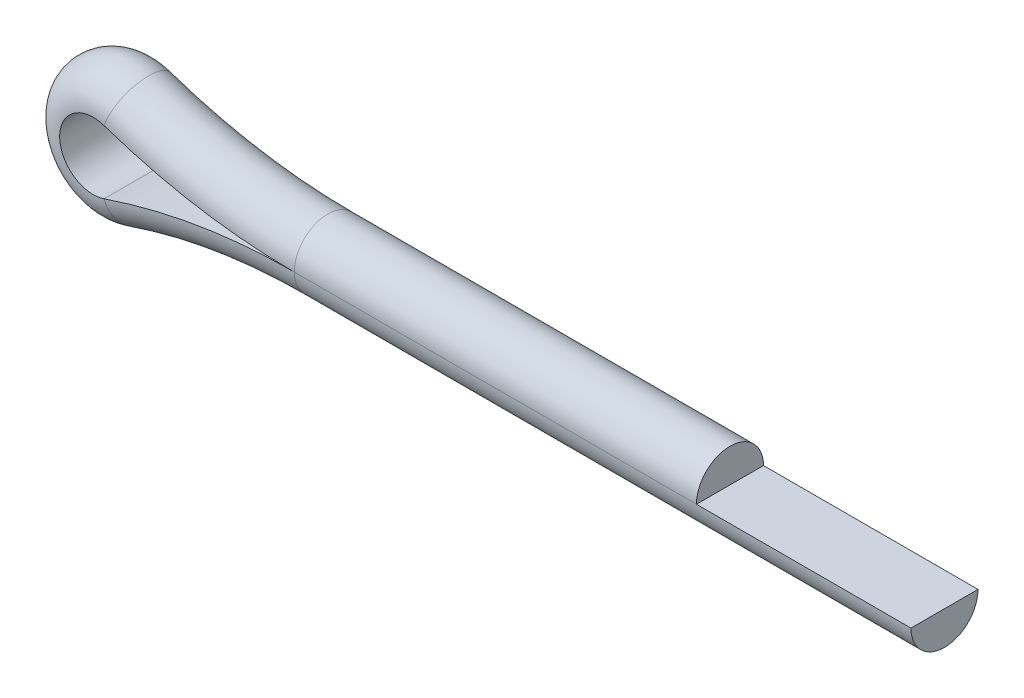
ISO-10303-21;
HEADER;
FILE_DESCRIPTION(('STEP AP214'),'2;1');
FILE_NAME('part.step','',(''),(''),'','','');
FILE_SCHEMA(('AUTOMOTIVE_DESIGN { 1 0 10303 214 1 1 1 1 }'));
ENDSEC;
DATA;
#1=APPLICATION_CONTEXT('core data for automotive mechanical design processes');
#2=APPLICATION_PROTOCOL_DEFINITION('international standard','automotive_design',2000,#1);
#3=PRODUCT_CONTEXT('',#1,'mechanical');
#4=PRODUCT('Part','Part','',(#3));
#5=PRODUCT_RELATED_PRODUCT_CATEGORY('part','',(#4));
#6=PRODUCT_DEFINITION_FORMATION('','',#4);
#7=PRODUCT_DEFINITION_CONTEXT('part definition',#1,'design');
#8=PRODUCT_DEFINITION('design','',#6,#7);
#9=PRODUCT_DEFINITION_SHAPE('','',#8);
#10=(LENGTH_UNIT() NAMED_UNIT(*) SI_UNIT(.MILLI.,.METRE.));
#11=(NAMED_UNIT(*) PLANE_ANGLE_UNIT() SI_UNIT($,.RADIAN.));
#12=(NAMED_UNIT(*) SI_UNIT($,.STERADIAN.) SOLID_ANGLE_UNIT());
#13=UNCERTAINTY_MEASURE_WITH_UNIT(LENGTH_MEASURE(1.E-05),#10,'distance_accuracy_value','');
#14=(GEOMETRIC_REPRESENTATION_CONTEXT(3) GLOBAL_UNCERTAINTY_ASSIGNED_CONTEXT((#13)) GLOBAL_UNIT_ASSIGNED_CONTEXT((#10,
#11,#12)) REPRESENTATION_CONTEXT('',''));
#15=CARTESIAN_POINT('',(0.,0.,0.));
#16=DIRECTION('',(0.,0.,1.));
#17=DIRECTION('',(1.,0.,0.));
#18=AXIS2_PLACEMENT_3D('',#15,#16,#17);
#19=CARTESIAN_POINT('',(2.,0.,-0.25));
#20=DIRECTION('',(0.,-1.,0.));
#21=DIRECTION('',(1.,0.,0.));
#22=AXIS2_PLACEMENT_3D('',#19,#20,#21);
#23=PLANE('',#22);
#24=DIRECTION('',(0.,0.,-1.));
#25=VECTOR('',#24,1.);
#26=CARTESIAN_POINT('',(2.,0.,-0.25));
#27=LINE('',#26,#25);
#28=CARTESIAN_POINT('',(2.,0.,0.25));
#29=VERTEX_POINT('',#28);
#30=CARTESIAN_POINT('',(2.,0.,-0.25));
#31=VERTEX_POINT('',#30);
#32=EDGE_CURVE('E139',#29,#31,#27,.T.);
#33=ORIENTED_EDGE('',*,*,#32,.F.);
#34=DIRECTION('',(1.,0.,0.));
#35=VECTOR('',#34,1.);
#36=CARTESIAN_POINT('',(2.,0.,0.25));
#37=LINE('',#36,#35);
#38=CARTESIAN_POINT('',(6.6,0.,0.25));
#39=VERTEX_POINT('',#38);
#40=EDGE_CURVE('E39',#29,#39,#37,.T.);
#41=ORIENTED_EDGE('',*,*,#40,.T.);
#42=DIRECTION('',(0.,0.,-1.));
#43=VECTOR('',#42,1.);
#44=CARTESIAN_POINT('',(6.6,0.,-0.25));
#45=LINE('',#44,#43);
#46=CARTESIAN_POINT('',(6.6,0.,-0.25));
#47=VERTEX_POINT('',#46);
#48=EDGE_CURVE('E46',#39,#47,#45,.T.);
#49=ORIENTED_EDGE('',*,*,#48,.T.);
#50=DIRECTION('',(1.,0.,0.));
#51=VECTOR('',#50,1.);
#52=CARTESIAN_POINT('',(2.,0.,-0.25));
#53=LINE('',#52,#51);
#54=EDGE_CURVE('E11',#31,#47,#53,.T.);
#55=ORIENTED_EDGE('',*,*,#54,.F.);
#56=EDGE_LOOP('',(#33,#41,#49,#55));
#57=FACE_BOUND('',#56,.T.);
#58=ADVANCED_FACE('F32',(#57),#23,.F.);
#59=CARTESIAN_POINT('',(2.,0.,0.));
#60=DIRECTION('',(1.,0.,0.));
#61=DIRECTION('',(0.,1.,0.));
#62=AXIS2_PLACEMENT_3D('',#59,#60,#61);
#63=CYLINDRICAL_SURFACE('',#62,0.25);
#64=CARTESIAN_POINT('',(2.,0.,0.));
#65=DIRECTION('',(-1.,0.,0.));
#66=DIRECTION('',(0.,0.,-1.));
#67=AXIS2_PLACEMENT_3D('',#64,#65,#66);
#68=CIRCLE('',#67,0.25);
#69=EDGE_CURVE('E136',#31,#29,#68,.T.);
#70=ORIENTED_EDGE('',*,*,#69,.F.);
#71=ORIENTED_EDGE('',*,*,#54,.T.);
#72=CARTESIAN_POINT('',(6.6,0.,0.));
#73=DIRECTION('',(-1.,0.,0.));
#74=DIRECTION('',(0.,0.,-1.));
#75=AXIS2_PLACEMENT_3D('',#72,#73,#74);
#76=CIRCLE('',#75,0.25);
#77=EDGE_CURVE('E52',#47,#39,#76,.T.);
#78=ORIENTED_EDGE('',*,*,#77,.T.);
#79=ORIENTED_EDGE('',*,*,#40,.F.);
#80=EDGE_LOOP('',(#70,#71,#78,#79));
#81=FACE_BOUND('',#80,.T.);
#82=ADVANCED_FACE('F151',(#81),#63,.T.);
#83=CARTESIAN_POINT('',(2.,-4.37499999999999,0.));
#84=DIRECTION('',(0.,0.,-1.));
#85=DIRECTION('',(-1.,0.,0.));
#86=AXIS2_PLACEMENT_3D('',#83,#84,#85);
#87=CYLINDRICAL_SURFACE('',#86,4.37499999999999);
#88=DIRECTION('',(0.,0.,-1.));
#89=VECTOR('',#88,1.);
#90=CARTESIAN_POINT('',(0.581081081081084,-0.236486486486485,-0.25));
#91=LINE('',#90,#89);
#92=CARTESIAN_POINT('',(0.581081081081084,-0.236486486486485,0.25));
#93=VERTEX_POINT('',#92);
#94=CARTESIAN_POINT('',(0.581081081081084,-0.236486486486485,-0.25));
#95=VERTEX_POINT('',#94);
#96=EDGE_CURVE('E127',#93,#95,#91,.T.);
#97=ORIENTED_EDGE('',*,*,#96,.F.);
#98=CARTESIAN_POINT('',(2.,-4.37499999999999,0.25));
#99=DIRECTION('',(0.,0.,-1.));
#100=DIRECTION('',(-1.,0.,0.));
#101=AXIS2_PLACEMENT_3D('',#98,#99,#100);
#102=CIRCLE('',#101,4.37499999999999);
#103=EDGE_CURVE('E142',#93,#29,#102,.T.);
#104=ORIENTED_EDGE('',*,*,#103,.T.);
#105=ORIENTED_EDGE('',*,*,#32,.T.);
#106=CARTESIAN_POINT('',(2.,-4.37499999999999,-0.25));
#107=DIRECTION('',(0.,0.,-1.));
#108=DIRECTION('',(-1.,0.,0.));
#109=AXIS2_PLACEMENT_3D('',#106,#107,#108);
#110=CIRCLE('',#109,4.37499999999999);
#111=EDGE_CURVE('E145',#95,#31,#110,.T.);
#112=ORIENTED_EDGE('',*,*,#111,.F.);
#113=EDGE_LOOP('',(#97,#104,#105,#112));
#114=FACE_BOUND('',#113,.T.);
#115=ADVANCED_FACE('F155',(#114),#87,.T.);
#116=CARTESIAN_POINT('',(2.,-4.37499999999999,0.));
#117=DIRECTION('',(0.,0.,-1.));
#118=DIRECTION('',(-1.,0.,0.));
#119=AXIS2_PLACEMENT_3D('',#116,#117,#118);
#120=TOROIDAL_SURFACE('',#119,4.37499999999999,0.25);
#121=CARTESIAN_POINT('',(0.581081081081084,-0.236486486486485,0.));
#122=DIRECTION('',(-0.945945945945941,-0.324324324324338,0.));
#123=DIRECTION('',(0.,0.,-1.));
#124=AXIS2_PLACEMENT_3D('',#121,#122,#123);
#125=CIRCLE('',#124,0.25);
#126=EDGE_CURVE('E124',#95,#93,#125,.T.);
#127=ORIENTED_EDGE('',*,*,#126,.F.);
#128=ORIENTED_EDGE('',*,*,#111,.T.);
#129=ORIENTED_EDGE('',*,*,#69,.T.);
#130=ORIENTED_EDGE('',*,*,#103,.F.);
#131=EDGE_LOOP('',(#127,#128,#129,#130));
#132=FACE_BOUND('',#131,.T.);
#133=ADVANCED_FACE('F157',(#132),#120,.T.);
#134=CARTESIAN_POINT('',(0.5,0.,0.));
#135=DIRECTION('',(0.,0.,1.));
#136=DIRECTION('',(1.,0.,0.));
#137=AXIS2_PLACEMENT_3D('',#134,#135,#136);
#138=CYLINDRICAL_SURFACE('',#137,0.249999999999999);
#139=DIRECTION('',(0.,0.,-1.));
#140=VECTOR('',#139,1.);
#141=CARTESIAN_POINT('',(0.581081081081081,0.236486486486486,-0.25));
#142=LINE('',#141,#140);
#143=CARTESIAN_POINT('',(0.581081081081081,0.236486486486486,0.25));
#144=VERTEX_POINT('',#143);
#145=CARTESIAN_POINT('',(0.581081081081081,0.236486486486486,-0.25));
#146=VERTEX_POINT('',#145);
#147=EDGE_CURVE('E96',#144,#146,#142,.T.);
#148=ORIENTED_EDGE('',*,*,#147,.F.);
#149=CARTESIAN_POINT('',(0.5,0.,0.25));
#150=DIRECTION('',(0.,0.,1.));
#151=DIRECTION('',(1.,0.,0.));
#152=AXIS2_PLACEMENT_3D('',#149,#150,#151);
#153=CIRCLE('',#152,0.249999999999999);
#154=EDGE_CURVE('E130',#144,#93,#153,.T.);
#155=ORIENTED_EDGE('',*,*,#154,.T.);
#156=ORIENTED_EDGE('',*,*,#96,.T.);
#157=CARTESIAN_POINT('',(0.5,0.,-0.25));
#158=DIRECTION('',(0.,0.,1.));
#159=DIRECTION('',(1.,0.,0.));
#160=AXIS2_PLACEMENT_3D('',#157,#158,#159);
#161=CIRCLE('',#160,0.249999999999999);
#162=EDGE_CURVE('E133',#146,#95,#161,.T.);
#163=ORIENTED_EDGE('',*,*,#162,.F.);
#164=EDGE_LOOP('',(#148,#155,#156,#163));
#165=FACE_BOUND('',#164,.T.);
#166=ADVANCED_FACE('F161',(#165),#138,.F.);
#167=CARTESIAN_POINT('',(0.5,0.,0.));
#168=DIRECTION('',(0.,0.,1.));
#169=DIRECTION('',(1.,0.,0.));
#170=AXIS2_PLACEMENT_3D('',#167,#168,#169);
#171=DEGENERATE_TOROIDAL_SURFACE('',#170,0.249999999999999,0.25,.T.);
#172=CARTESIAN_POINT('',(0.581081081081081,0.236486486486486,0.));
#173=DIRECTION('',(0.945945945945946,-0.324324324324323,0.));
#174=DIRECTION('',(0.,0.,-1.));
#175=AXIS2_PLACEMENT_3D('',#172,#173,#174);
#176=CIRCLE('',#175,0.25);
#177=EDGE_CURVE('E92',#146,#144,#176,.T.);
#178=ORIENTED_EDGE('',*,*,#177,.F.);
#179=ORIENTED_EDGE('',*,*,#162,.T.);
#180=ORIENTED_EDGE('',*,*,#126,.T.);
#181=ORIENTED_EDGE('',*,*,#154,.F.);
#182=EDGE_LOOP('',(#178,#179,#180,#181));
#183=FACE_BOUND('',#182,.T.);
#184=ADVANCED_FACE('F162',(#183),#171,.T.);
#185=CARTESIAN_POINT('',(2.,4.37500000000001,0.));
#186=DIRECTION('',(0.,0.,-1.));
#187=DIRECTION('',(-1.,0.,0.));
#188=AXIS2_PLACEMENT_3D('',#185,#186,#187);
#189=CYLINDRICAL_SURFACE('',#188,4.37500000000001);
#190=DIRECTION('',(0.,0.,-1.));
#191=VECTOR('',#190,1.);
#192=CARTESIAN_POINT('',(2.,0.,-0.25));
#193=LINE('',#192,#191);
#194=CARTESIAN_POINT('',(2.,0.,0.25));
#195=VERTEX_POINT('',#194);
#196=CARTESIAN_POINT('',(2.,0.,-0.25));
#197=VERTEX_POINT('',#196);
#198=EDGE_CURVE('E99',#195,#197,#193,.T.);
#199=ORIENTED_EDGE('',*,*,#198,.F.);
#200=CARTESIAN_POINT('',(2.,4.37500000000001,0.25));
#201=DIRECTION('',(0.,0.,-1.));
#202=DIRECTION('',(-1.,0.,0.));
#203=AXIS2_PLACEMENT_3D('',#200,#201,#202);
#204=CIRCLE('',#203,4.37500000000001);
#205=EDGE_CURVE('E84',#195,#144,#204,.T.);
#206=ORIENTED_EDGE('',*,*,#205,.T.);
#207=ORIENTED_EDGE('',*,*,#147,.T.);
#208=CARTESIAN_POINT('',(2.,4.37500000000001,-0.25));
#209=DIRECTION('',(0.,0.,-1.));
#210=DIRECTION('',(-1.,0.,0.));
#211=AXIS2_PLACEMENT_3D('',#208,#209,#210);
#212=CIRCLE('',#211,4.37500000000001);
#213=EDGE_CURVE('E95',#197,#146,#212,.T.);
#214=ORIENTED_EDGE('',*,*,#213,.F.);
#215=EDGE_LOOP('',(#199,#206,#207,#214));
#216=FACE_BOUND('',#215,.T.);
#217=ADVANCED_FACE('F101',(#216),#189,.T.);
#218=CARTESIAN_POINT('',(2.,4.37500000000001,0.));
#219=DIRECTION('',(0.,0.,-1.));
#220=DIRECTION('',(-1.,0.,0.));
#221=AXIS2_PLACEMENT_3D('',#218,#219,#220);
#222=TOROIDAL_SURFACE('',#221,4.37500000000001,0.25);
#223=CARTESIAN_POINT('',(2.,0.,0.));
#224=DIRECTION('',(1.,0.,0.));
#225=DIRECTION('',(0.,0.,-1.));
#226=AXIS2_PLACEMENT_3D('',#223,#224,#225);
#227=CIRCLE('',#226,0.25);
#228=EDGE_CURVE('E89',#197,#195,#227,.T.);
#229=ORIENTED_EDGE('',*,*,#228,.F.);
#230=ORIENTED_EDGE('',*,*,#213,.T.);
#231=ORIENTED_EDGE('',*,*,#177,.T.);
#232=ORIENTED_EDGE('',*,*,#205,.F.);
#233=EDGE_LOOP('',(#229,#230,#231,#232));
#234=FACE_BOUND('',#233,.T.);
#235=ADVANCED_FACE('F86',(#234),#222,.T.);
#236=CARTESIAN_POINT('',(2.,0.,0.));
#237=DIRECTION('',(1.,0.,0.));
#238=DIRECTION('',(0.,1.,0.));
#239=AXIS2_PLACEMENT_3D('',#236,#237,#238);
#240=CYLINDRICAL_SURFACE('',#239,0.25);
#241=CARTESIAN_POINT('',(5.,0.,0.));
#242=DIRECTION('',(1.,0.,0.));
#243=DIRECTION('',(0.,0.,-1.));
#244=AXIS2_PLACEMENT_3D('',#241,#242,#243);
#245=CIRCLE('',#244,0.25);
#246=CARTESIAN_POINT('',(5.,0.,-0.25));
#247=VERTEX_POINT('',#246);
#248=CARTESIAN_POINT('',(5.,0.,0.25));
#249=VERTEX_POINT('',#248);
#250=EDGE_CURVE('E116',#247,#249,#245,.T.);
#251=ORIENTED_EDGE('',*,*,#250,.F.);
#252=DIRECTION('',(1.,0.,0.));
#253=VECTOR('',#252,1.);
#254=CARTESIAN_POINT('',(2.,0.,-0.25));
#255=LINE('',#254,#253);
#256=EDGE_CURVE('E112',#197,#247,#255,.T.);
#257=ORIENTED_EDGE('',*,*,#256,.F.);
#258=ORIENTED_EDGE('',*,*,#228,.T.);
#259=DIRECTION('',(1.,0.,0.));
#260=VECTOR('',#259,1.);
#261=CARTESIAN_POINT('',(2.,0.,0.25));
#262=LINE('',#261,#260);
#263=EDGE_CURVE('E103',#195,#249,#262,.T.);
#264=ORIENTED_EDGE('',*,*,#263,.T.);
#265=EDGE_LOOP('',(#251,#257,#258,#264));
#266=FACE_BOUND('',#265,.T.);
#267=ADVANCED_FACE('F114',(#266),#240,.T.);
#268=CARTESIAN_POINT('',(2.,0.,-0.25));
#269=DIRECTION('',(0.,-1.,0.));
#270=DIRECTION('',(1.,0.,0.));
#271=AXIS2_PLACEMENT_3D('',#268,#269,#270);
#272=PLANE('',#271);
#273=DIRECTION('',(0.,0.,-1.));
#274=VECTOR('',#273,1.);
#275=CARTESIAN_POINT('',(5.,0.,-0.25));
#276=LINE('',#275,#274);
#277=EDGE_CURVE('E108',#249,#247,#276,.T.);
#278=ORIENTED_EDGE('',*,*,#277,.F.);
#279=ORIENTED_EDGE('',*,*,#263,.F.);
#280=ORIENTED_EDGE('',*,*,#198,.T.);
#281=ORIENTED_EDGE('',*,*,#256,.T.);
#282=EDGE_LOOP('',(#278,#279,#280,#281));
#283=FACE_BOUND('',#282,.T.);
#284=ADVANCED_FACE('F106',(#283),#272,.T.);
#285=CARTESIAN_POINT('',(6.6,0.,0.));
#286=DIRECTION('',(-1.,0.,0.));
#287=DIRECTION('',(0.,0.,-1.));
#288=AXIS2_PLACEMENT_3D('',#285,#286,#287);
#289=PLANE('',#288);
#290=ORIENTED_EDGE('',*,*,#77,.F.);
#291=ORIENTED_EDGE('',*,*,#48,.F.);
#292=EDGE_LOOP('',(#290,#291));
#293=FACE_BOUND('',#292,.T.);
#294=ADVANCED_FACE('F224',(#293),#289,.F.);
#295=CARTESIAN_POINT('',(5.,0.,0.));
#296=DIRECTION('',(1.,0.,0.));
#297=DIRECTION('',(0.,0.,-1.));
#298=AXIS2_PLACEMENT_3D('',#295,#296,#297);
#299=PLANE('',#298);
#300=ORIENTED_EDGE('',*,*,#250,.T.);
#301=ORIENTED_EDGE('',*,*,#277,.T.);
#302=EDGE_LOOP('',(#300,#301));
#303=FACE_BOUND('',#302,.T.);
#304=ADVANCED_FACE('F233',(#303),#299,.T.);
#305=CLOSED_SHELL('',(#58,#82,#115,#133,#166,#184,#217,#235,#267,#284,#294,#304));
#306=MANIFOLD_SOLID_BREP('B2',#305);
#307=ADVANCED_BREP_SHAPE_REPRESENTATION('',(#18,#306),#14);
#308=SHAPE_DEFINITION_REPRESENTATION(#9,#307);
ENDSEC;
END-ISO-10303-21;
